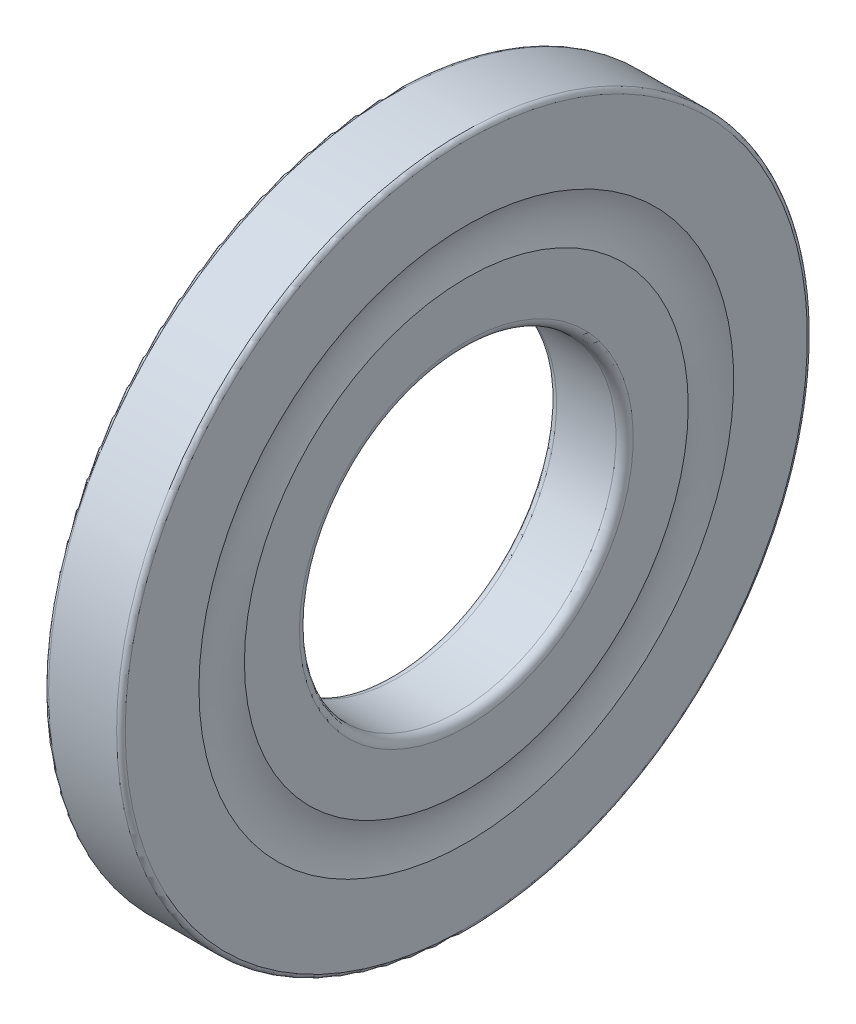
ISO-10303-21;
HEADER;
FILE_DESCRIPTION(('STEP AP214'),'2;1');
FILE_NAME('part.step','',(''),(''),'','','');
FILE_SCHEMA(('AUTOMOTIVE_DESIGN { 1 0 10303 214 1 1 1 1 }'));
ENDSEC;
DATA;
#1=APPLICATION_CONTEXT('core data for automotive mechanical design processes');
#2=APPLICATION_PROTOCOL_DEFINITION('international standard','automotive_design',2000,#1);
#3=PRODUCT_CONTEXT('',#1,'mechanical');
#4=PRODUCT('Part','Part','',(#3));
#5=PRODUCT_RELATED_PRODUCT_CATEGORY('part','',(#4));
#6=PRODUCT_DEFINITION_FORMATION('','',#4);
#7=PRODUCT_DEFINITION_CONTEXT('part definition',#1,'design');
#8=PRODUCT_DEFINITION('design','',#6,#7);
#9=PRODUCT_DEFINITION_SHAPE('','',#8);
#10=(LENGTH_UNIT() NAMED_UNIT(*) SI_UNIT(.MILLI.,.METRE.));
#11=(NAMED_UNIT(*) PLANE_ANGLE_UNIT() SI_UNIT($,.RADIAN.));
#12=(NAMED_UNIT(*) SI_UNIT($,.STERADIAN.) SOLID_ANGLE_UNIT());
#13=UNCERTAINTY_MEASURE_WITH_UNIT(LENGTH_MEASURE(1.E-05),#10,'distance_accuracy_value','');
#14=(GEOMETRIC_REPRESENTATION_CONTEXT(3) GLOBAL_UNCERTAINTY_ASSIGNED_CONTEXT((#13)) GLOBAL_UNIT_ASSIGNED_CONTEXT((#10,
#11,#12)) REPRESENTATION_CONTEXT('',''));
#15=CARTESIAN_POINT('',(0.,0.,0.));
#16=DIRECTION('',(0.,0.,1.));
#17=DIRECTION('',(1.,0.,0.));
#18=AXIS2_PLACEMENT_3D('',#15,#16,#17);
#19=CARTESIAN_POINT('',(-4.19999999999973,2.13717932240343E-12,0.));
#20=DIRECTION('',(-1.00000000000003,0.,0.));
#21=DIRECTION('',(0.,0.,1.00000000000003));
#22=AXIS2_PLACEMENT_3D('',#19,#20,#21);
#23=TOROIDAL_SURFACE('',#22,5.8,0.3);
#24=CARTESIAN_POINT('',(-4.19999999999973,2.13717932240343E-12,0.));
#25=DIRECTION('',(-1.00000000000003,0.,0.));
#26=DIRECTION('',(0.,0.,1.00000000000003));
#27=AXIS2_PLACEMENT_3D('',#24,#25,#26);
#28=CIRCLE('',#27,5.5);
#29=CARTESIAN_POINT('',(-4.1999999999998,2.10431541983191E-12,5.50000000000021));
#30=VERTEX_POINT('',#29);
#31=EDGE_CURVE('E10',#30,#30,#28,.T.);
#32=ORIENTED_EDGE('',*,*,#31,.F.);
#33=EDGE_LOOP('',(#32));
#34=FACE_BOUND('',#33,.T.);
#35=CARTESIAN_POINT('',(-4.50000000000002,0.,0.));
#36=DIRECTION('',(-1.00000000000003,0.,0.));
#37=DIRECTION('',(0.,0.,1.00000000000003));
#38=AXIS2_PLACEMENT_3D('',#35,#36,#37);
#39=CIRCLE('',#38,5.8);
#40=CARTESIAN_POINT('',(-4.5000000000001,0.,5.80000000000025));
#41=VERTEX_POINT('',#40);
#42=EDGE_CURVE('E58',#41,#41,#39,.T.);
#43=ORIENTED_EDGE('',*,*,#42,.T.);
#44=EDGE_LOOP('',(#43));
#45=FACE_BOUND('',#44,.T.);
#46=ADVANCED_FACE('F24',(#34,#45),#23,.T.);
#47=CARTESIAN_POINT('',(-4.50000000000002,0.,0.));
#48=DIRECTION('',(-1.00000000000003,0.,0.));
#49=DIRECTION('',(0.,0.,1.00000000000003));
#50=AXIS2_PLACEMENT_3D('',#47,#48,#49);
#51=CYLINDRICAL_SURFACE('',#50,5.5);
#52=CARTESIAN_POINT('',(-2.13749999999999,0.,0.));
#53=DIRECTION('',(-1.00000000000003,0.,0.));
#54=DIRECTION('',(0.,0.,1.00000000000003));
#55=AXIS2_PLACEMENT_3D('',#52,#53,#54);
#56=CIRCLE('',#55,5.5);
#57=CARTESIAN_POINT('',(-2.13750000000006,0.,5.5000000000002));
#58=VERTEX_POINT('',#57);
#59=EDGE_CURVE('E30',#58,#58,#56,.T.);
#60=ORIENTED_EDGE('',*,*,#59,.F.);
#61=EDGE_LOOP('',(#60));
#62=FACE_BOUND('',#61,.T.);
#63=ORIENTED_EDGE('',*,*,#31,.T.);
#64=EDGE_LOOP('',(#63));
#65=FACE_BOUND('',#64,.T.);
#66=ADVANCED_FACE('F107',(#62,#65),#51,.F.);
#67=CARTESIAN_POINT('',(-2.13749999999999,0.,0.));
#68=DIRECTION('',(-1.00000000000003,0.,0.));
#69=DIRECTION('',(0.,0.,1.00000000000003));
#70=AXIS2_PLACEMENT_3D('',#67,#68,#69);
#71=TOROIDAL_SURFACE('',#70,5.8,0.3);
#72=CARTESIAN_POINT('',(-1.83750000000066,9.15933995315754E-13,0.));
#73=DIRECTION('',(-1.00000000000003,0.,0.));
#74=DIRECTION('',(0.,0.,1.00000000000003));
#75=AXIS2_PLACEMENT_3D('',#72,#73,#74);
#76=CIRCLE('',#75,5.8);
#77=CARTESIAN_POINT('',(-1.83750000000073,8.81277516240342E-13,5.8000000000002));
#78=VERTEX_POINT('',#77);
#79=EDGE_CURVE('E34',#78,#78,#76,.T.);
#80=ORIENTED_EDGE('',*,*,#79,.F.);
#81=EDGE_LOOP('',(#80));
#82=FACE_BOUND('',#81,.T.);
#83=ORIENTED_EDGE('',*,*,#59,.T.);
#84=EDGE_LOOP('',(#83));
#85=FACE_BOUND('',#84,.T.);
#86=ADVANCED_FACE('F102',(#82,#85),#71,.T.);
#87=CARTESIAN_POINT('',(-1.83749999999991,5.79999999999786,0.));
#88=DIRECTION('',(-1.00000000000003,0.,0.));
#89=DIRECTION('',(0.,0.,1.00000000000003));
#90=AXIS2_PLACEMENT_3D('',#87,#88,#89);
#91=PLANE('',#90);
#92=CARTESIAN_POINT('',(-1.83750000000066,9.15933995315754E-13,0.));
#93=DIRECTION('',(-1.00000000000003,0.,0.));
#94=DIRECTION('',(0.,0.,1.00000000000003));
#95=AXIS2_PLACEMENT_3D('',#92,#93,#94);
#96=CIRCLE('',#95,7.71032047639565);
#97=CARTESIAN_POINT('',(-1.83750000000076,8.69862864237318E-13,7.71032047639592));
#98=VERTEX_POINT('',#97);
#99=EDGE_CURVE('E38',#98,#98,#96,.T.);
#100=ORIENTED_EDGE('',*,*,#99,.F.);
#101=EDGE_LOOP('',(#100));
#102=FACE_BOUND('',#101,.T.);
#103=ORIENTED_EDGE('',*,*,#79,.T.);
#104=EDGE_LOOP('',(#103));
#105=FACE_BOUND('',#104,.T.);
#106=ADVANCED_FACE('F96',(#102,#105),#91,.F.);
#107=CARTESIAN_POINT('',(0.,0.,0.));
#108=DIRECTION('',(-1.00000000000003,0.,0.));
#109=DIRECTION('',(0.,0.,1.00000000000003));
#110=AXIS2_PLACEMENT_3D('',#107,#108,#109);
#111=TOROIDAL_SURFACE('',#110,8.5,2.);
#112=CARTESIAN_POINT('',(-1.83750000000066,8.88178419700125E-13,0.));
#113=DIRECTION('',(-1.00000000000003,0.,0.));
#114=DIRECTION('',(0.,0.,1.00000000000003));
#115=AXIS2_PLACEMENT_3D('',#112,#113,#114);
#116=CIRCLE('',#115,9.28967952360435);
#117=CARTESIAN_POINT('',(-1.83750000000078,8.32670215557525E-13,9.28967952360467));
#118=VERTEX_POINT('',#117);
#119=EDGE_CURVE('E43',#118,#118,#116,.T.);
#120=ORIENTED_EDGE('',*,*,#119,.F.);
#121=EDGE_LOOP('',(#120));
#122=FACE_BOUND('',#121,.T.);
#123=ORIENTED_EDGE('',*,*,#99,.T.);
#124=EDGE_LOOP('',(#123));
#125=FACE_BOUND('',#124,.T.);
#126=ADVANCED_FACE('F90',(#122,#125),#111,.F.);
#127=CARTESIAN_POINT('',(-1.83749999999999,9.28967952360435,0.));
#128=DIRECTION('',(-1.00000000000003,0.,0.));
#129=DIRECTION('',(0.,0.,1.00000000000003));
#130=AXIS2_PLACEMENT_3D('',#127,#128,#129);
#131=PLANE('',#130);
#132=CARTESIAN_POINT('',(-1.83750000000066,9.15933995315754E-13,0.));
#133=DIRECTION('',(-1.00000000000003,0.,0.));
#134=DIRECTION('',(0.,0.,1.00000000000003));
#135=AXIS2_PLACEMENT_3D('',#132,#133,#134);
#136=CIRCLE('',#135,11.85);
#137=CARTESIAN_POINT('',(-1.83750000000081,8.45127223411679E-13,11.8500000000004));
#138=VERTEX_POINT('',#137);
#139=EDGE_CURVE('E46',#138,#138,#136,.T.);
#140=ORIENTED_EDGE('',*,*,#139,.F.);
#141=EDGE_LOOP('',(#140));
#142=FACE_BOUND('',#141,.T.);
#143=ORIENTED_EDGE('',*,*,#119,.T.);
#144=EDGE_LOOP('',(#143));
#145=FACE_BOUND('',#144,.T.);
#146=ADVANCED_FACE('F84',(#142,#145),#131,.F.);
#147=CARTESIAN_POINT('',(-1.98749999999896,0.,0.));
#148=DIRECTION('',(-1.00000000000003,0.,0.));
#149=DIRECTION('',(0.,0.,1.00000000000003));
#150=AXIS2_PLACEMENT_3D('',#147,#148,#149);
#151=TOROIDAL_SURFACE('',#150,11.85,0.15);
#152=CARTESIAN_POINT('',(-1.98749999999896,0.,0.));
#153=DIRECTION('',(-1.00000000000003,0.,0.));
#154=DIRECTION('',(0.,0.,1.00000000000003));
#155=AXIS2_PLACEMENT_3D('',#152,#153,#154);
#156=CIRCLE('',#155,12.);
#157=CARTESIAN_POINT('',(-1.98749999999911,0.,12.0000000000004));
#158=VERTEX_POINT('',#157);
#159=EDGE_CURVE('E49',#158,#158,#156,.T.);
#160=ORIENTED_EDGE('',*,*,#159,.F.);
#161=EDGE_LOOP('',(#160));
#162=FACE_BOUND('',#161,.T.);
#163=ORIENTED_EDGE('',*,*,#139,.T.);
#164=EDGE_LOOP('',(#163));
#165=FACE_BOUND('',#164,.T.);
#166=ADVANCED_FACE('F78',(#162,#165),#151,.T.);
#167=CARTESIAN_POINT('',(-4.50000000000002,0.,0.));
#168=DIRECTION('',(-1.00000000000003,0.,0.));
#169=DIRECTION('',(0.,0.,1.00000000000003));
#170=AXIS2_PLACEMENT_3D('',#167,#168,#169);
#171=CYLINDRICAL_SURFACE('',#170,12.);
#172=CARTESIAN_POINT('',(-4.3500000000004,-2.13717932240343E-12,0.));
#173=DIRECTION('',(-1.00000000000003,0.,0.));
#174=DIRECTION('',(0.,0.,1.00000000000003));
#175=AXIS2_PLACEMENT_3D('',#172,#173,#174);
#176=CIRCLE('',#175,12.);
#177=CARTESIAN_POINT('',(-4.35000000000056,-2.20888238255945E-12,12.0000000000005));
#178=VERTEX_POINT('',#177);
#179=EDGE_CURVE('E52',#178,#178,#176,.T.);
#180=ORIENTED_EDGE('',*,*,#179,.F.);
#181=EDGE_LOOP('',(#180));
#182=FACE_BOUND('',#181,.T.);
#183=ORIENTED_EDGE('',*,*,#159,.T.);
#184=EDGE_LOOP('',(#183));
#185=FACE_BOUND('',#184,.T.);
#186=ADVANCED_FACE('F72',(#182,#185),#171,.T.);
#187=CARTESIAN_POINT('',(-4.3500000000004,-2.13717932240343E-12,0.));
#188=DIRECTION('',(-1.00000000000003,0.,0.));
#189=DIRECTION('',(0.,0.,1.00000000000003));
#190=AXIS2_PLACEMENT_3D('',#187,#188,#189);
#191=TOROIDAL_SURFACE('',#190,11.85,0.150000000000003);
#192=CARTESIAN_POINT('',(-4.50000000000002,0.,0.));
#193=DIRECTION('',(-1.00000000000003,0.,0.));
#194=DIRECTION('',(0.,0.,1.00000000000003));
#195=AXIS2_PLACEMENT_3D('',#192,#193,#194);
#196=CIRCLE('',#195,11.85);
#197=CARTESIAN_POINT('',(-4.50000000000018,0.,11.8500000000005));
#198=VERTEX_POINT('',#197);
#199=EDGE_CURVE('E55',#198,#198,#196,.T.);
#200=ORIENTED_EDGE('',*,*,#199,.F.);
#201=EDGE_LOOP('',(#200));
#202=FACE_BOUND('',#201,.T.);
#203=ORIENTED_EDGE('',*,*,#179,.T.);
#204=EDGE_LOOP('',(#203));
#205=FACE_BOUND('',#204,.T.);
#206=ADVANCED_FACE('F66',(#202,#205),#191,.T.);
#207=CARTESIAN_POINT('',(-4.50000000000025,5.80000000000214,0.));
#208=DIRECTION('',(1.00000000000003,0.,0.));
#209=DIRECTION('',(0.,0.,-1.00000000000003));
#210=AXIS2_PLACEMENT_3D('',#207,#208,#209);
#211=PLANE('',#210);
#212=ORIENTED_EDGE('',*,*,#42,.F.);
#213=EDGE_LOOP('',(#212));
#214=FACE_BOUND('',#213,.T.);
#215=ORIENTED_EDGE('',*,*,#199,.T.);
#216=EDGE_LOOP('',(#215));
#217=FACE_BOUND('',#216,.T.);
#218=ADVANCED_FACE('F63',(#214,#217),#211,.F.);
#219=CLOSED_SHELL('',(#46,#66,#86,#106,#126,#146,#166,#186,#206,#218));
#220=MANIFOLD_SOLID_BREP('B2',#219);
#221=ADVANCED_BREP_SHAPE_REPRESENTATION('',(#18,#220),#14);
#222=SHAPE_DEFINITION_REPRESENTATION(#9,#221);
ENDSEC;
END-ISO-10303-21;
